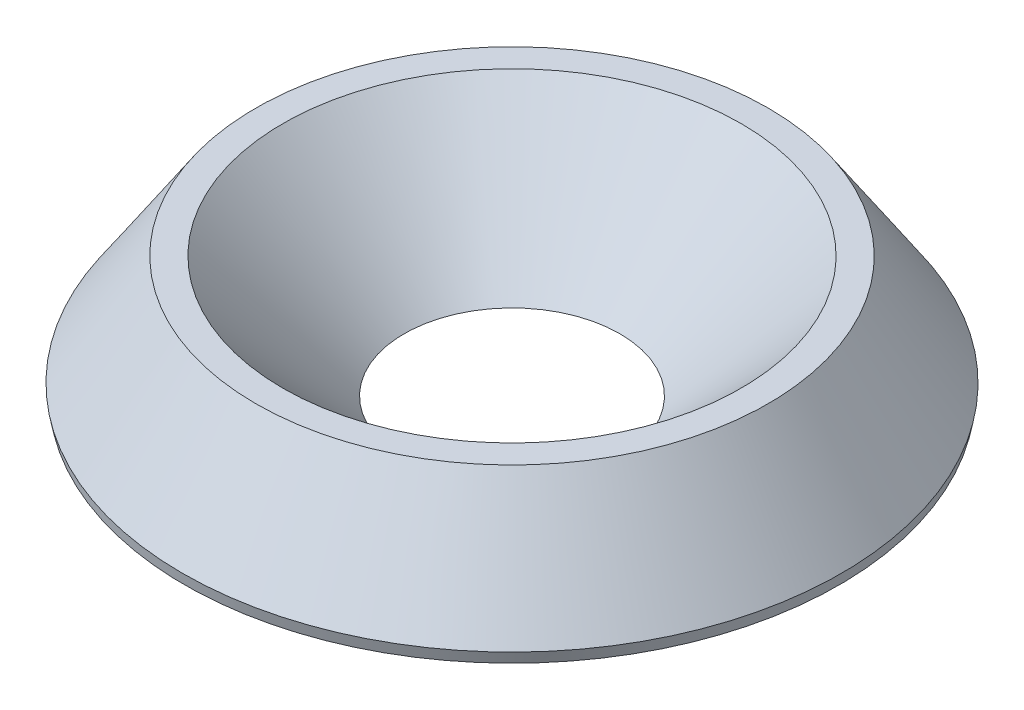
ISO-10303-21;
HEADER;
FILE_DESCRIPTION(('STEP AP214'),'2;1');
FILE_NAME('part.step','',(''),(''),'','','');
FILE_SCHEMA(('AUTOMOTIVE_DESIGN { 1 0 10303 214 1 1 1 1 }'));
ENDSEC;
DATA;
#1=APPLICATION_CONTEXT('core data for automotive mechanical design processes');
#2=APPLICATION_PROTOCOL_DEFINITION('international standard','automotive_design',2000,#1);
#3=PRODUCT_CONTEXT('',#1,'mechanical');
#4=PRODUCT('Part','Part','',(#3));
#5=PRODUCT_RELATED_PRODUCT_CATEGORY('part','',(#4));
#6=PRODUCT_DEFINITION_FORMATION('','',#4);
#7=PRODUCT_DEFINITION_CONTEXT('part definition',#1,'design');
#8=PRODUCT_DEFINITION('design','',#6,#7);
#9=PRODUCT_DEFINITION_SHAPE('','',#8);
#10=(LENGTH_UNIT() NAMED_UNIT(*) SI_UNIT(.MILLI.,.METRE.));
#11=(NAMED_UNIT(*) PLANE_ANGLE_UNIT() SI_UNIT($,.RADIAN.));
#12=(NAMED_UNIT(*) SI_UNIT($,.STERADIAN.) SOLID_ANGLE_UNIT());
#13=UNCERTAINTY_MEASURE_WITH_UNIT(LENGTH_MEASURE(1.E-05),#10,'distance_accuracy_value','');
#14=(GEOMETRIC_REPRESENTATION_CONTEXT(3) GLOBAL_UNCERTAINTY_ASSIGNED_CONTEXT((#13)) GLOBAL_UNIT_ASSIGNED_CONTEXT((#10,
#11,#12)) REPRESENTATION_CONTEXT('',''));
#15=CARTESIAN_POINT('',(0.,0.,0.));
#16=DIRECTION('',(0.,0.,1.));
#17=DIRECTION('',(1.,0.,0.));
#18=AXIS2_PLACEMENT_3D('',#15,#16,#17);
#19=CARTESIAN_POINT('',(0.,7.46410161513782,0.));
#20=DIRECTION('',(0.,-1.,0.));
#21=DIRECTION('',(0.,0.,-1.));
#22=AXIS2_PLACEMENT_3D('',#19,#20,#21);
#23=CONICAL_SURFACE('',#22,12.5,0.588002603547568);
#24=CARTESIAN_POINT('',(0.,7.88012676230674,0.));
#25=DIRECTION('',(0.,1.,0.));
#26=DIRECTION('',(0.,0.,1.));
#27=AXIS2_PLACEMENT_3D('',#24,#25,#26);
#28=CIRCLE('',#27,12.2226499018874);
#29=CARTESIAN_POINT('',(0.,7.88012676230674,12.2226499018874));
#30=VERTEX_POINT('',#29);
#31=EDGE_CURVE('E10',#30,#30,#28,.T.);
#32=ORIENTED_EDGE('',*,*,#31,.T.);
#33=EDGE_LOOP('',(#32));
#34=FACE_BOUND('',#33,.T.);
#35=CARTESIAN_POINT('',(0.,11.9641016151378,0.));
#36=DIRECTION('',(0.,-1.,0.));
#37=DIRECTION('',(0.,0.,-1.));
#38=AXIS2_PLACEMENT_3D('',#35,#36,#37);
#39=CIRCLE('',#38,9.5);
#40=CARTESIAN_POINT('',(0.,11.9641016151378,-9.5));
#41=VERTEX_POINT('',#40);
#42=EDGE_CURVE('E37',#41,#41,#39,.T.);
#43=ORIENTED_EDGE('',*,*,#42,.T.);
#44=EDGE_LOOP('',(#43));
#45=FACE_BOUND('',#44,.T.);
#46=ADVANCED_FACE('F27',(#34,#45),#23,.T.);
#47=CARTESIAN_POINT('',(8.50000000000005,11.9641016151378,0.));
#48=DIRECTION('',(0.,1.,0.));
#49=DIRECTION('',(0.,0.,1.));
#50=AXIS2_PLACEMENT_3D('',#47,#48,#49);
#51=PLANE('',#50);
#52=CARTESIAN_POINT('',(0.,11.9641016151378,0.));
#53=DIRECTION('',(0.,-1.,0.));
#54=DIRECTION('',(0.,0.,-1.));
#55=AXIS2_PLACEMENT_3D('',#52,#53,#54);
#56=CIRCLE('',#55,8.50000000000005);
#57=CARTESIAN_POINT('',(0.,11.9641016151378,-8.50000000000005));
#58=VERTEX_POINT('',#57);
#59=EDGE_CURVE('E41',#58,#58,#56,.T.);
#60=ORIENTED_EDGE('',*,*,#59,.T.);
#61=EDGE_LOOP('',(#60));
#62=FACE_BOUND('',#61,.T.);
#63=ORIENTED_EDGE('',*,*,#42,.F.);
#64=EDGE_LOOP('',(#63));
#65=FACE_BOUND('',#64,.T.);
#66=ADVANCED_FACE('F63',(#62,#65),#51,.T.);
#67=CARTESIAN_POINT('',(0.,11.9641016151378,0.));
#68=DIRECTION('',(0.,1.,0.));
#69=DIRECTION('',(0.,0.,1.));
#70=AXIS2_PLACEMENT_3D('',#67,#68,#69);
#71=CONICAL_SURFACE('',#70,8.50000000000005,0.785398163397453);
#72=CARTESIAN_POINT('',(0.,7.46410161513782,0.));
#73=DIRECTION('',(0.,-1.,0.));
#74=DIRECTION('',(0.,0.,-1.));
#75=AXIS2_PLACEMENT_3D('',#72,#73,#74);
#76=CIRCLE('',#75,4.);
#77=CARTESIAN_POINT('',(0.,7.46410161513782,-4.));
#78=VERTEX_POINT('',#77);
#79=EDGE_CURVE('E46',#78,#78,#76,.T.);
#80=ORIENTED_EDGE('',*,*,#79,.T.);
#81=EDGE_LOOP('',(#80));
#82=FACE_BOUND('',#81,.T.);
#83=ORIENTED_EDGE('',*,*,#59,.F.);
#84=EDGE_LOOP('',(#83));
#85=FACE_BOUND('',#84,.T.);
#86=ADVANCED_FACE('F50',(#82,#85),#71,.F.);
#87=CARTESIAN_POINT('',(12.5,7.46410161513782,0.));
#88=DIRECTION('',(0.,-1.,0.));
#89=DIRECTION('',(0.,0.,-1.));
#90=AXIS2_PLACEMENT_3D('',#87,#88,#89);
#91=PLANE('',#90);
#92=CARTESIAN_POINT('',(0.,7.46410161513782,0.));
#93=DIRECTION('',(0.,-1.,0.));
#94=DIRECTION('',(0.,0.,-1.));
#95=AXIS2_PLACEMENT_3D('',#92,#93,#94);
#96=CIRCLE('',#95,12.1394448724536);
#97=CARTESIAN_POINT('',(0.,7.46410161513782,-12.1394448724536));
#98=VERTEX_POINT('',#97);
#99=EDGE_CURVE('E33',#98,#98,#96,.T.);
#100=ORIENTED_EDGE('',*,*,#99,.T.);
#101=EDGE_LOOP('',(#100));
#102=FACE_BOUND('',#101,.T.);
#103=ORIENTED_EDGE('',*,*,#79,.F.);
#104=EDGE_LOOP('',(#103));
#105=FACE_BOUND('',#104,.T.);
#106=ADVANCED_FACE('F53',(#102,#105),#91,.T.);
#107=CARTESIAN_POINT('',(0.,7.46410161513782,0.));
#108=DIRECTION('',(0.,1.,0.));
#109=DIRECTION('',(0.,0.,1.));
#110=AXIS2_PLACEMENT_3D('',#107,#108,#109);
#111=CONICAL_SURFACE('',#110,12.1394448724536,0.197395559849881);
#112=ORIENTED_EDGE('',*,*,#31,.F.);
#113=EDGE_LOOP('',(#112));
#114=FACE_BOUND('',#113,.T.);
#115=ORIENTED_EDGE('',*,*,#99,.F.);
#116=EDGE_LOOP('',(#115));
#117=FACE_BOUND('',#116,.T.);
#118=ADVANCED_FACE('F55',(#114,#117),#111,.T.);
#119=CLOSED_SHELL('',(#46,#66,#86,#106,#118));
#120=MANIFOLD_SOLID_BREP('B2',#119);
#121=ADVANCED_BREP_SHAPE_REPRESENTATION('',(#18,#120),#14);
#122=SHAPE_DEFINITION_REPRESENTATION(#9,#121);
ENDSEC;
END-ISO-10303-21;
